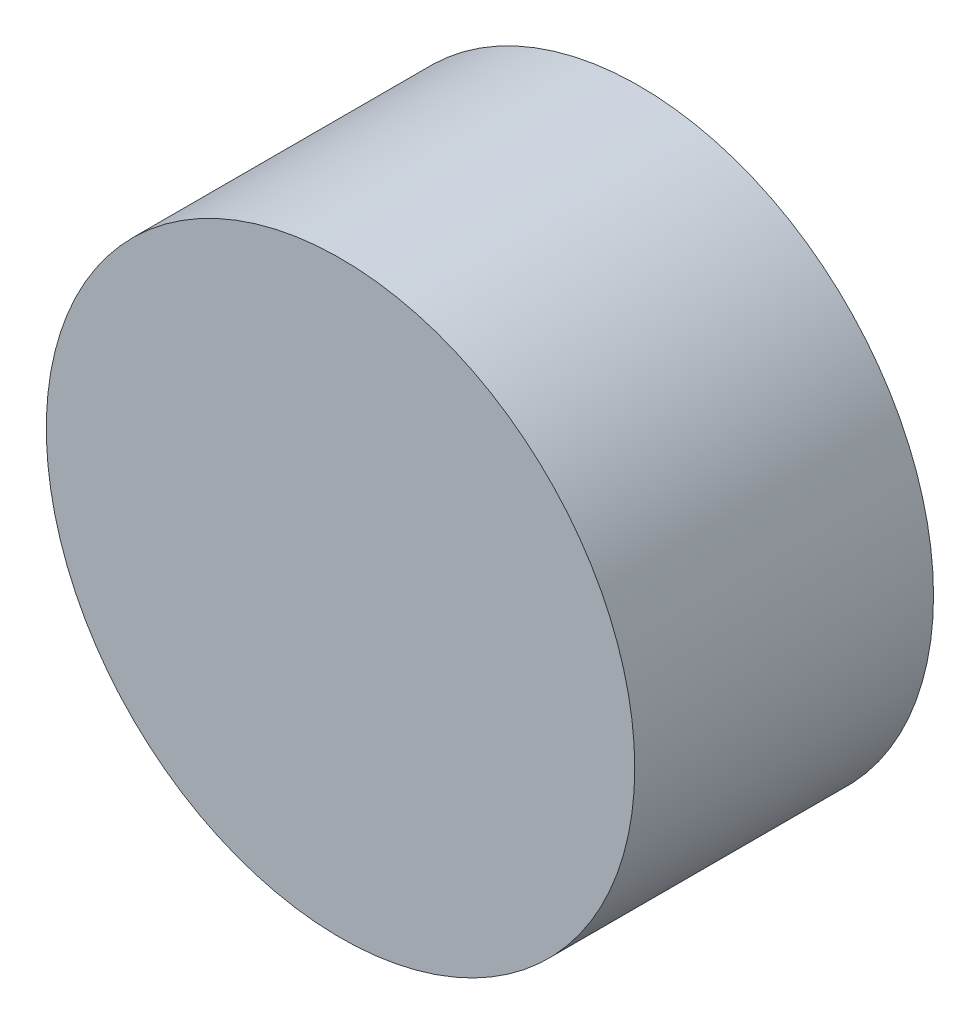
from build123d import *

# Parameters (mm, degrees)
SKETCH1_R          = 32.5
BASE_EXTRUDE_DEPTH = 33


with BuildPart() as part:
    # Sketch1 → Base-Extrude (new body)
    with BuildSketch(Plane.XY):
        Circle(SKETCH1_R)
    extrude(amount=BASE_EXTRUDE_DEPTH)


solid = part.part
